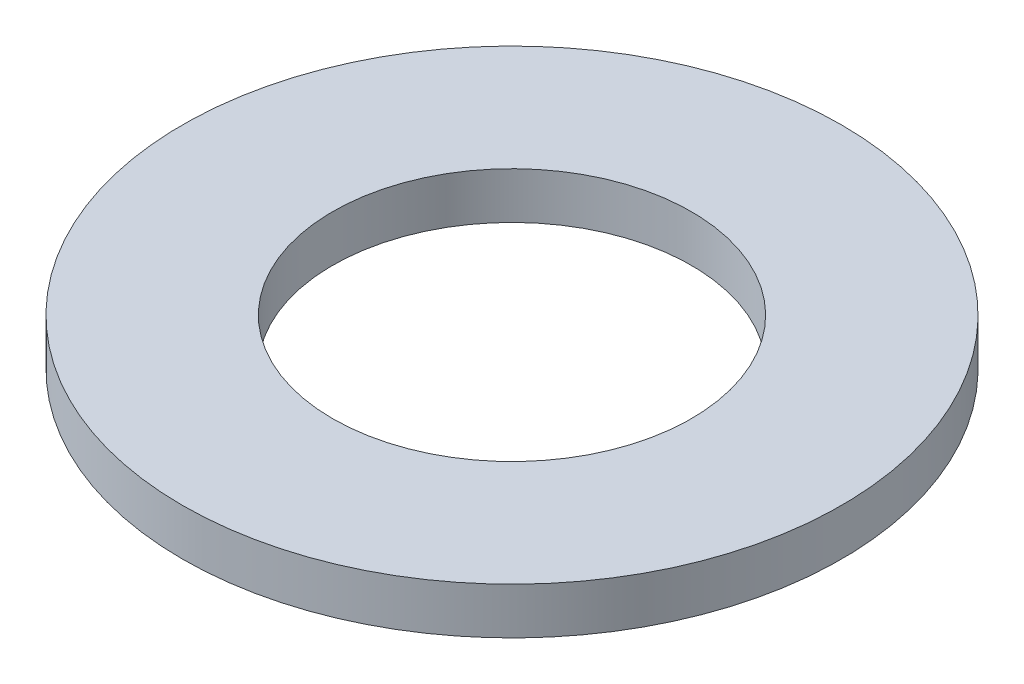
ISO-10303-21;
HEADER;
FILE_DESCRIPTION(('STEP AP214'),'2;1');
FILE_NAME('part.step','',(''),(''),'','','');
FILE_SCHEMA(('AUTOMOTIVE_DESIGN { 1 0 10303 214 1 1 1 1 }'));
ENDSEC;
DATA;
#1=APPLICATION_CONTEXT('core data for automotive mechanical design processes');
#2=APPLICATION_PROTOCOL_DEFINITION('international standard','automotive_design',2000,#1);
#3=PRODUCT_CONTEXT('',#1,'mechanical');
#4=PRODUCT('Part','Part','',(#3));
#5=PRODUCT_RELATED_PRODUCT_CATEGORY('part','',(#4));
#6=PRODUCT_DEFINITION_FORMATION('','',#4);
#7=PRODUCT_DEFINITION_CONTEXT('part definition',#1,'design');
#8=PRODUCT_DEFINITION('design','',#6,#7);
#9=PRODUCT_DEFINITION_SHAPE('','',#8);
#10=(LENGTH_UNIT() NAMED_UNIT(*) SI_UNIT(.MILLI.,.METRE.));
#11=(NAMED_UNIT(*) PLANE_ANGLE_UNIT() SI_UNIT($,.RADIAN.));
#12=(NAMED_UNIT(*) SI_UNIT($,.STERADIAN.) SOLID_ANGLE_UNIT());
#13=UNCERTAINTY_MEASURE_WITH_UNIT(LENGTH_MEASURE(1.E-05),#10,'distance_accuracy_value','');
#14=(GEOMETRIC_REPRESENTATION_CONTEXT(3) GLOBAL_UNCERTAINTY_ASSIGNED_CONTEXT((#13)) GLOBAL_UNIT_ASSIGNED_CONTEXT((#10,
#11,#12)) REPRESENTATION_CONTEXT('',''));
#15=CARTESIAN_POINT('',(0.,0.,0.));
#16=DIRECTION('',(0.,0.,1.));
#17=DIRECTION('',(1.,0.,0.));
#18=AXIS2_PLACEMENT_3D('',#15,#16,#17);
#19=CARTESIAN_POINT('',(0.,1.905,0.));
#20=DIRECTION('',(0.,-1.,0.));
#21=DIRECTION('',(0.,0.,-1.));
#22=AXIS2_PLACEMENT_3D('',#19,#20,#21);
#23=CYLINDRICAL_SURFACE('',#22,13.4874);
#24=CARTESIAN_POINT('',(0.,1.905,0.));
#25=DIRECTION('',(0.,1.,0.));
#26=DIRECTION('',(0.,0.,1.));
#27=AXIS2_PLACEMENT_3D('',#24,#25,#26);
#28=CIRCLE('',#27,13.4874);
#29=CARTESIAN_POINT('',(0.,1.905,-13.4874));
#30=VERTEX_POINT('',#29);
#31=EDGE_CURVE('E10',#30,#30,#28,.T.);
#32=CARTESIAN_POINT('',(0.,0.,0.));
#33=DIRECTION('',(0.,1.,0.));
#34=DIRECTION('',(0.,0.,1.));
#35=AXIS2_PLACEMENT_3D('',#32,#33,#34);
#36=CIRCLE('',#35,13.4874);
#37=CARTESIAN_POINT('',(0.,0.,-13.4874));
#38=VERTEX_POINT('',#37);
#39=EDGE_CURVE('E35',#38,#38,#36,.T.);
#40=CARTESIAN_POINT('',(0.,1.905,-13.4874));
#41=CARTESIAN_POINT('',(0.,1.88515625,-13.4874));
#42=CARTESIAN_POINT('',(0.,1.8653125,-13.4874));
#43=CARTESIAN_POINT('',(0.,1.825625,-13.4874));
#44=CARTESIAN_POINT('',(0.,1.80578125,-13.4874));
#45=CARTESIAN_POINT('',(0.,1.76609375,-13.4874));
#46=CARTESIAN_POINT('',(0.,1.74625,-13.4874));
#47=CARTESIAN_POINT('',(0.,1.7065625,-13.4874));
#48=CARTESIAN_POINT('',(0.,1.68671875,-13.4874));
#49=CARTESIAN_POINT('',(0.,1.64703125,-13.4874));
#50=CARTESIAN_POINT('',(0.,1.6271875,-13.4874));
#51=CARTESIAN_POINT('',(0.,1.5875,-13.4874));
#52=CARTESIAN_POINT('',(0.,1.56765625,-13.4874));
#53=CARTESIAN_POINT('',(0.,1.52796875,-13.4874));
#54=CARTESIAN_POINT('',(0.,1.508125,-13.4874));
#55=CARTESIAN_POINT('',(0.,1.4684375,-13.4874));
#56=CARTESIAN_POINT('',(0.,1.44859375,-13.4874));
#57=CARTESIAN_POINT('',(0.,1.40890625,-13.4874));
#58=CARTESIAN_POINT('',(0.,1.3890625,-13.4874));
#59=CARTESIAN_POINT('',(0.,1.349375,-13.4874));
#60=CARTESIAN_POINT('',(0.,1.32953125,-13.4874));
#61=CARTESIAN_POINT('',(0.,1.28984375,-13.4874));
#62=CARTESIAN_POINT('',(0.,1.27,-13.4874));
#63=CARTESIAN_POINT('',(0.,1.2303125,-13.4874));
#64=CARTESIAN_POINT('',(0.,1.21046875,-13.4874));
#65=CARTESIAN_POINT('',(0.,1.17078125,-13.4874));
#66=CARTESIAN_POINT('',(0.,1.1509375,-13.4874));
#67=CARTESIAN_POINT('',(0.,1.11125,-13.4874));
#68=CARTESIAN_POINT('',(0.,1.09140625,-13.4874));
#69=CARTESIAN_POINT('',(0.,1.05171875,-13.4874));
#70=CARTESIAN_POINT('',(0.,1.031875,-13.4874));
#71=CARTESIAN_POINT('',(0.,0.9921875,-13.4874));
#72=CARTESIAN_POINT('',(0.,0.97234375,-13.4874));
#73=CARTESIAN_POINT('',(0.,0.93265625,-13.4874));
#74=CARTESIAN_POINT('',(0.,0.9128125,-13.4874));
#75=CARTESIAN_POINT('',(0.,0.873125,-13.4874));
#76=CARTESIAN_POINT('',(0.,0.85328125,-13.4874));
#77=CARTESIAN_POINT('',(0.,0.81359375,-13.4874));
#78=CARTESIAN_POINT('',(0.,0.79375,-13.4874));
#79=CARTESIAN_POINT('',(0.,0.7540625,-13.4874));
#80=CARTESIAN_POINT('',(0.,0.73421875,-13.4874));
#81=CARTESIAN_POINT('',(0.,0.69453125,-13.4874));
#82=CARTESIAN_POINT('',(0.,0.6746875,-13.4874));
#83=CARTESIAN_POINT('',(0.,0.635,-13.4874));
#84=CARTESIAN_POINT('',(0.,0.61515625,-13.4874));
#85=CARTESIAN_POINT('',(0.,0.57546875,-13.4874));
#86=CARTESIAN_POINT('',(0.,0.555625,-13.4874));
#87=CARTESIAN_POINT('',(0.,0.5159375,-13.4874));
#88=CARTESIAN_POINT('',(0.,0.49609375,-13.4874));
#89=CARTESIAN_POINT('',(0.,0.45640625,-13.4874));
#90=CARTESIAN_POINT('',(0.,0.4365625,-13.4874));
#91=CARTESIAN_POINT('',(0.,0.396875,-13.4874));
#92=CARTESIAN_POINT('',(0.,0.37703125,-13.4874));
#93=CARTESIAN_POINT('',(0.,0.33734375,-13.4874));
#94=CARTESIAN_POINT('',(0.,0.3175,-13.4874));
#95=CARTESIAN_POINT('',(0.,0.2778125,-13.4874));
#96=CARTESIAN_POINT('',(0.,0.25796875,-13.4874));
#97=CARTESIAN_POINT('',(0.,0.21828125,-13.4874));
#98=CARTESIAN_POINT('',(0.,0.1984375,-13.4874));
#99=CARTESIAN_POINT('',(0.,0.15875,-13.4874));
#100=CARTESIAN_POINT('',(0.,0.13890625,-13.4874));
#101=CARTESIAN_POINT('',(0.,0.09921875,-13.4874));
#102=CARTESIAN_POINT('',(0.,0.0793749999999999,-13.4874));
#103=CARTESIAN_POINT('',(0.,0.0396874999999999,-13.4874));
#104=CARTESIAN_POINT('',(0.,0.01984375,-13.4874));
#105=CARTESIAN_POINT('',(0.,0.,-13.4874));
#106=B_SPLINE_CURVE_WITH_KNOTS('',3,(#40,#41,#42,#43,#44,#45,#46,#47,#48,#49,#50,#51,#52,#53,
#54,#55,#56,#57,#58,#59,#60,#61,#62,#63,#64,#65,#66,#67,#68,#69,#70,#71,#72,#73,#74,#75,#76,#77,
#78,#79,#80,#81,#82,#83,#84,#85,#86,#87,#88,#89,#90,#91,#92,#93,#94,#95,#96,#97,#98,#99,#100,
#101,#102,#103,#104,#105),.UNSPECIFIED.,.F.,.F.,(4,2,2,2,2,2,2,2,2,2,2,2,2,2,2,2,2,2,2,2,2,2,2,
2,2,2,2,2,2,2,2,2,4),(0.,0.0595312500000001,0.1190625,0.17859375,0.238125,0.29765625,0.3571875,
0.41671875,0.47625,0.53578125,0.5953125,0.65484375,0.714375,0.77390625,0.8334375,0.89296875,
0.9525,1.01203125,1.0715625,1.13109375,1.190625,1.25015625,1.3096875,1.36921875,1.42875,
1.48828125,1.5478125,1.60734375,1.666875,1.72640625,1.7859375,1.84546875,1.905),.UNSPECIFIED.);
#107=EDGE_CURVE('BSEAM32',#30,#38,#106,.T.);
#108=ORIENTED_EDGE('',*,*,#31,.F.);
#109=ORIENTED_EDGE('',*,*,#39,.T.);
#110=ORIENTED_EDGE('',*,*,#107,.T.);
#111=ORIENTED_EDGE('',*,*,#107,.F.);
#112=EDGE_LOOP('',(#108,#110,#109,#111));
#113=FACE_BOUND('',#112,.T.);
#114=ADVANCED_FACE('F32',(#113),#23,.T.);
#115=CARTESIAN_POINT('',(0.,1.905,0.));
#116=DIRECTION('',(0.,1.,0.));
#117=DIRECTION('',(0.,0.,1.));
#118=AXIS2_PLACEMENT_3D('',#115,#116,#117);
#119=PLANE('',#118);
#120=CARTESIAN_POINT('',(0.,1.905,0.));
#121=DIRECTION('',(0.,1.,0.));
#122=DIRECTION('',(0.,0.,1.));
#123=AXIS2_PLACEMENT_3D('',#120,#121,#122);
#124=CIRCLE('',#123,7.3406);
#125=CARTESIAN_POINT('',(0.,1.905,7.3406));
#126=VERTEX_POINT('',#125);
#127=EDGE_CURVE('E44',#126,#126,#124,.T.);
#128=ORIENTED_EDGE('',*,*,#127,.F.);
#129=EDGE_LOOP('',(#128));
#130=FACE_BOUND('',#129,.T.);
#131=ORIENTED_EDGE('',*,*,#31,.T.);
#132=EDGE_LOOP('',(#131));
#133=FACE_BOUND('',#132,.T.);
#134=ADVANCED_FACE('F59',(#130,#133),#119,.T.);
#135=CARTESIAN_POINT('',(0.,0.,0.));
#136=DIRECTION('',(0.,1.,0.));
#137=DIRECTION('',(0.,0.,1.));
#138=AXIS2_PLACEMENT_3D('',#135,#136,#137);
#139=PLANE('',#138);
#140=CARTESIAN_POINT('',(0.,0.,0.));
#141=DIRECTION('',(0.,1.,0.));
#142=DIRECTION('',(0.,0.,1.));
#143=AXIS2_PLACEMENT_3D('',#140,#141,#142);
#144=CIRCLE('',#143,7.3406);
#145=CARTESIAN_POINT('',(0.,0.,7.3406));
#146=VERTEX_POINT('',#145);
#147=EDGE_CURVE('E42',#146,#146,#144,.T.);
#148=ORIENTED_EDGE('',*,*,#147,.T.);
#149=EDGE_LOOP('',(#148));
#150=FACE_BOUND('',#149,.T.);
#151=ORIENTED_EDGE('',*,*,#39,.F.);
#152=EDGE_LOOP('',(#151));
#153=FACE_BOUND('',#152,.T.);
#154=ADVANCED_FACE('F50',(#150,#153),#139,.F.);
#155=CARTESIAN_POINT('',(0.,0.,0.));
#156=DIRECTION('',(0.,1.,0.));
#157=DIRECTION('',(0.,0.,1.));
#158=AXIS2_PLACEMENT_3D('',#155,#156,#157);
#159=CYLINDRICAL_SURFACE('',#158,7.3406);
#160=CARTESIAN_POINT('',(0.,0.,7.3406));
#161=CARTESIAN_POINT('',(0.,0.01984375,7.3406));
#162=CARTESIAN_POINT('',(0.,0.0396875,7.3406));
#163=CARTESIAN_POINT('',(0.,0.079375,7.3406));
#164=CARTESIAN_POINT('',(0.,0.09921875,7.3406));
#165=CARTESIAN_POINT('',(0.,0.13890625,7.3406));
#166=CARTESIAN_POINT('',(0.,0.15875,7.3406));
#167=CARTESIAN_POINT('',(0.,0.1984375,7.3406));
#168=CARTESIAN_POINT('',(0.,0.21828125,7.3406));
#169=CARTESIAN_POINT('',(0.,0.25796875,7.3406));
#170=CARTESIAN_POINT('',(0.,0.2778125,7.3406));
#171=CARTESIAN_POINT('',(0.,0.3175,7.3406));
#172=CARTESIAN_POINT('',(0.,0.33734375,7.3406));
#173=CARTESIAN_POINT('',(0.,0.37703125,7.3406));
#174=CARTESIAN_POINT('',(0.,0.396875,7.3406));
#175=CARTESIAN_POINT('',(0.,0.4365625,7.3406));
#176=CARTESIAN_POINT('',(0.,0.45640625,7.3406));
#177=CARTESIAN_POINT('',(0.,0.49609375,7.3406));
#178=CARTESIAN_POINT('',(0.,0.5159375,7.3406));
#179=CARTESIAN_POINT('',(0.,0.555625,7.3406));
#180=CARTESIAN_POINT('',(0.,0.57546875,7.3406));
#181=CARTESIAN_POINT('',(0.,0.61515625,7.3406));
#182=CARTESIAN_POINT('',(0.,0.635,7.3406));
#183=CARTESIAN_POINT('',(0.,0.6746875,7.3406));
#184=CARTESIAN_POINT('',(0.,0.69453125,7.3406));
#185=CARTESIAN_POINT('',(0.,0.73421875,7.3406));
#186=CARTESIAN_POINT('',(0.,0.7540625,7.3406));
#187=CARTESIAN_POINT('',(0.,0.79375,7.3406));
#188=CARTESIAN_POINT('',(0.,0.81359375,7.3406));
#189=CARTESIAN_POINT('',(0.,0.85328125,7.3406));
#190=CARTESIAN_POINT('',(0.,0.873125,7.3406));
#191=CARTESIAN_POINT('',(0.,0.9128125,7.3406));
#192=CARTESIAN_POINT('',(0.,0.93265625,7.3406));
#193=CARTESIAN_POINT('',(0.,0.97234375,7.3406));
#194=CARTESIAN_POINT('',(0.,0.9921875,7.3406));
#195=CARTESIAN_POINT('',(0.,1.031875,7.3406));
#196=CARTESIAN_POINT('',(0.,1.05171875,7.3406));
#197=CARTESIAN_POINT('',(0.,1.09140625,7.3406));
#198=CARTESIAN_POINT('',(0.,1.11125,7.3406));
#199=CARTESIAN_POINT('',(0.,1.1509375,7.3406));
#200=CARTESIAN_POINT('',(0.,1.17078125,7.3406));
#201=CARTESIAN_POINT('',(0.,1.21046875,7.3406));
#202=CARTESIAN_POINT('',(0.,1.2303125,7.3406));
#203=CARTESIAN_POINT('',(0.,1.27,7.3406));
#204=CARTESIAN_POINT('',(0.,1.28984375,7.3406));
#205=CARTESIAN_POINT('',(0.,1.32953125,7.3406));
#206=CARTESIAN_POINT('',(0.,1.349375,7.3406));
#207=CARTESIAN_POINT('',(0.,1.3890625,7.3406));
#208=CARTESIAN_POINT('',(0.,1.40890625,7.3406));
#209=CARTESIAN_POINT('',(0.,1.44859375,7.3406));
#210=CARTESIAN_POINT('',(0.,1.4684375,7.3406));
#211=CARTESIAN_POINT('',(0.,1.508125,7.3406));
#212=CARTESIAN_POINT('',(0.,1.52796875,7.3406));
#213=CARTESIAN_POINT('',(0.,1.56765625,7.3406));
#214=CARTESIAN_POINT('',(0.,1.5875,7.3406));
#215=CARTESIAN_POINT('',(0.,1.6271875,7.3406));
#216=CARTESIAN_POINT('',(0.,1.64703125,7.3406));
#217=CARTESIAN_POINT('',(0.,1.68671875,7.3406));
#218=CARTESIAN_POINT('',(0.,1.7065625,7.3406));
#219=CARTESIAN_POINT('',(0.,1.74625,7.3406));
#220=CARTESIAN_POINT('',(0.,1.76609375,7.3406));
#221=CARTESIAN_POINT('',(0.,1.80578125,7.3406));
#222=CARTESIAN_POINT('',(0.,1.825625,7.3406));
#223=CARTESIAN_POINT('',(0.,1.8653125,7.3406));
#224=CARTESIAN_POINT('',(0.,1.88515625,7.3406));
#225=CARTESIAN_POINT('',(0.,1.905,7.3406));
#226=B_SPLINE_CURVE_WITH_KNOTS('',3,(#160,#161,#162,#163,#164,#165,#166,#167,#168,#169,#170,
#171,#172,#173,#174,#175,#176,#177,#178,#179,#180,#181,#182,#183,#184,#185,#186,#187,#188,#189,
#190,#191,#192,#193,#194,#195,#196,#197,#198,#199,#200,#201,#202,#203,#204,#205,#206,#207,#208,
#209,#210,#211,#212,#213,#214,#215,#216,#217,#218,#219,#220,#221,#222,#223,#224,#225),
.UNSPECIFIED.,.F.,.F.,(4,2,2,2,2,2,2,2,2,2,2,2,2,2,2,2,2,2,2,2,2,2,2,2,2,2,2,2,2,2,2,2,4),(0.,
0.05953125,0.1190625,0.17859375,0.238125,0.29765625,0.3571875,0.41671875,0.47625,0.53578125,
0.5953125,0.65484375,0.714375,0.77390625,0.8334375,0.89296875,0.9525,1.01203125,1.0715625,
1.13109375,1.190625,1.25015625,1.3096875,1.36921875,1.42875,1.48828125,1.5478125,1.60734375,
1.666875,1.72640625,1.7859375,1.84546875,1.905),.UNSPECIFIED.);
#227=EDGE_CURVE('BSEAM53',#146,#126,#226,.T.);
#228=ORIENTED_EDGE('',*,*,#147,.F.);
#229=ORIENTED_EDGE('',*,*,#127,.T.);
#230=ORIENTED_EDGE('',*,*,#227,.T.);
#231=ORIENTED_EDGE('',*,*,#227,.F.);
#232=EDGE_LOOP('',(#228,#230,#229,#231));
#233=FACE_BOUND('',#232,.T.);
#234=ADVANCED_FACE('F53',(#233),#159,.F.);
#235=CLOSED_SHELL('',(#114,#134,#154,#234));
#236=MANIFOLD_SOLID_BREP('B2',#235);
#237=ADVANCED_BREP_SHAPE_REPRESENTATION('',(#18,#236),#14);
#238=SHAPE_DEFINITION_REPRESENTATION(#9,#237);
ENDSEC;
END-ISO-10303-21;
